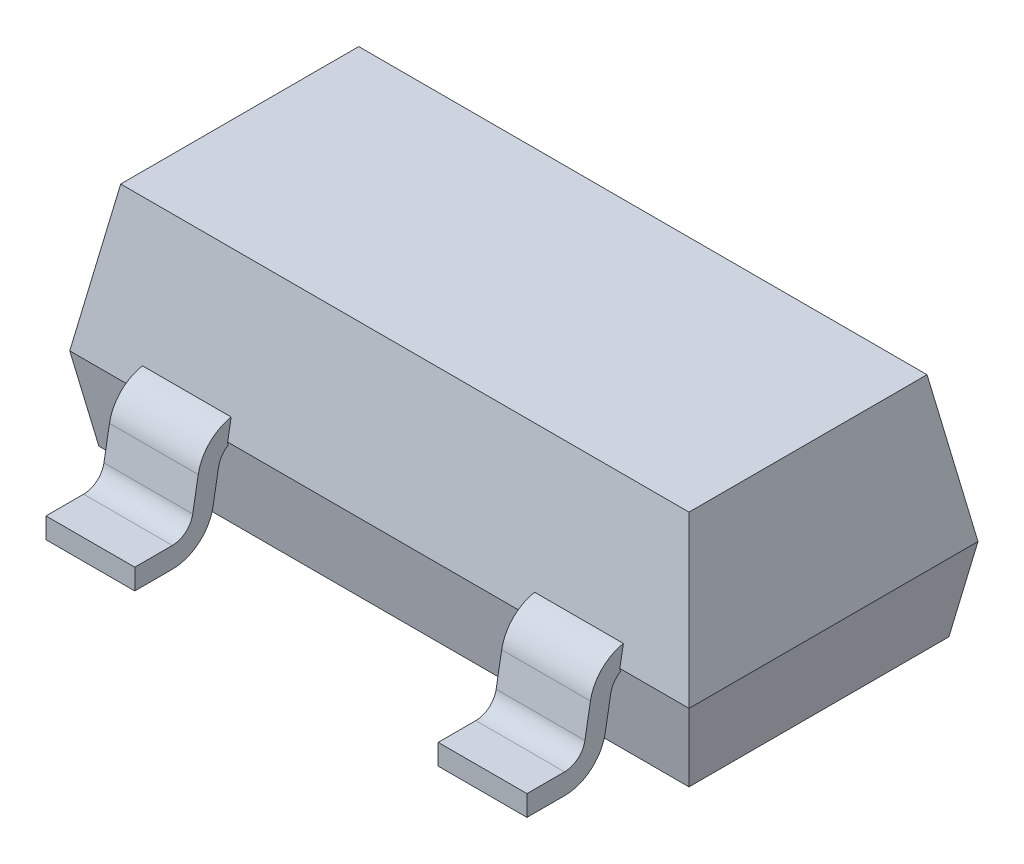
ISO-10303-21;
HEADER;
FILE_DESCRIPTION(('STEP AP214'),'2;1');
FILE_NAME('part.step','',(''),(''),'','','');
FILE_SCHEMA(('AUTOMOTIVE_DESIGN { 1 0 10303 214 1 1 1 1 }'));
ENDSEC;
DATA;
#1=APPLICATION_CONTEXT('core data for automotive mechanical design processes');
#2=APPLICATION_PROTOCOL_DEFINITION('international standard','automotive_design',2000,#1);
#3=PRODUCT_CONTEXT('',#1,'mechanical');
#4=PRODUCT('Part','Part','',(#3));
#5=PRODUCT_RELATED_PRODUCT_CATEGORY('part','',(#4));
#6=PRODUCT_DEFINITION_FORMATION('','',#4);
#7=PRODUCT_DEFINITION_CONTEXT('part definition',#1,'design');
#8=PRODUCT_DEFINITION('design','',#6,#7);
#9=PRODUCT_DEFINITION_SHAPE('','',#8);
#10=(LENGTH_UNIT() NAMED_UNIT(*) SI_UNIT(.MILLI.,.METRE.));
#11=(NAMED_UNIT(*) PLANE_ANGLE_UNIT() SI_UNIT($,.RADIAN.));
#12=(NAMED_UNIT(*) SI_UNIT($,.STERADIAN.) SOLID_ANGLE_UNIT());
#13=UNCERTAINTY_MEASURE_WITH_UNIT(LENGTH_MEASURE(1.E-05),#10,'distance_accuracy_value','');
#14=(GEOMETRIC_REPRESENTATION_CONTEXT(3) GLOBAL_UNCERTAINTY_ASSIGNED_CONTEXT((#13)) GLOBAL_UNIT_ASSIGNED_CONTEXT((#10,
#11,#12)) REPRESENTATION_CONTEXT('',''));
#15=CARTESIAN_POINT('',(0.,0.,0.));
#16=DIRECTION('',(0.,0.,1.));
#17=DIRECTION('',(1.,0.,0.));
#18=AXIS2_PLACEMENT_3D('',#15,#16,#17);
#19=CARTESIAN_POINT('',(-1.5,0.4,0.7));
#20=DIRECTION('',(0.,0.173648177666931,0.984807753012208));
#21=DIRECTION('',(0.,-0.984807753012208,0.173648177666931));
#22=AXIS2_PLACEMENT_3D('',#19,#20,#21);
#23=PLANE('',#22);
#24=DIRECTION('',(0.,-0.984807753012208,0.173648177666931));
#25=VECTOR('',#24,1.);
#26=CARTESIAN_POINT('',(-1.165,0.160230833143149,0.742277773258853));
#27=LINE('',#26,#25);
#28=CARTESIAN_POINT('',(-1.165,0.496466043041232,0.682990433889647));
#29=VERTEX_POINT('',#28);
#30=CARTESIAN_POINT('',(-1.165,0.4,0.7));
#31=VERTEX_POINT('',#30);
#32=EDGE_CURVE('E378',#29,#31,#27,.T.);
#33=ORIENTED_EDGE('',*,*,#32,.F.);
#34=DIRECTION('',(1.,0.,0.));
#35=VECTOR('',#34,1.);
#36=CARTESIAN_POINT('',(-1.165,0.496466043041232,0.682990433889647));
#37=LINE('',#36,#35);
#38=CARTESIAN_POINT('',(-0.735,0.496466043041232,0.682990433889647));
#39=VERTEX_POINT('',#38);
#40=EDGE_CURVE('E376',#29,#39,#37,.T.);
#41=ORIENTED_EDGE('',*,*,#40,.T.);
#42=DIRECTION('',(0.,-0.984807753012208,0.173648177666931));
#43=VECTOR('',#42,1.);
#44=CARTESIAN_POINT('',(-0.735,0.42003009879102,0.696468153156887));
#45=LINE('',#44,#43);
#46=CARTESIAN_POINT('',(-0.735,0.4,0.7));
#47=VERTEX_POINT('',#46);
#48=EDGE_CURVE('E374',#39,#47,#45,.T.);
#49=ORIENTED_EDGE('',*,*,#48,.T.);
#50=DIRECTION('',(-1.,0.,0.));
#51=VECTOR('',#50,1.);
#52=CARTESIAN_POINT('',(-1.5,0.4,0.7));
#53=LINE('',#52,#51);
#54=CARTESIAN_POINT('',(0.735,0.4,0.7));
#55=VERTEX_POINT('',#54);
#56=EDGE_CURVE('E46',#55,#47,#53,.T.);
#57=ORIENTED_EDGE('',*,*,#56,.F.);
#58=DIRECTION('',(0.,0.984807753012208,-0.173648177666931));
#59=VECTOR('',#58,1.);
#60=CARTESIAN_POINT('',(0.735,0.42003009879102,0.696468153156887));
#61=LINE('',#60,#59);
#62=CARTESIAN_POINT('',(0.735,0.496466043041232,0.682990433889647));
#63=VERTEX_POINT('',#62);
#64=EDGE_CURVE('E12',#55,#63,#61,.T.);
#65=ORIENTED_EDGE('',*,*,#64,.T.);
#66=DIRECTION('',(1.,0.,0.));
#67=VECTOR('',#66,1.);
#68=CARTESIAN_POINT('',(-1.165,0.496466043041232,0.682990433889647));
#69=LINE('',#68,#67);
#70=CARTESIAN_POINT('',(1.165,0.496466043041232,0.682990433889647));
#71=VERTEX_POINT('',#70);
#72=EDGE_CURVE('E370',#63,#71,#69,.T.);
#73=ORIENTED_EDGE('',*,*,#72,.T.);
#74=DIRECTION('',(0.,-0.984807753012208,0.173648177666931));
#75=VECTOR('',#74,1.);
#76=CARTESIAN_POINT('',(1.165,0.160230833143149,0.742277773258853));
#77=LINE('',#76,#75);
#78=CARTESIAN_POINT('',(1.165,0.4,0.7));
#79=VERTEX_POINT('',#78);
#80=EDGE_CURVE('E372',#71,#79,#77,.T.);
#81=ORIENTED_EDGE('',*,*,#80,.T.);
#82=CARTESIAN_POINT('',(1.5,0.4,0.7));
#83=VERTEX_POINT('',#82);
#84=EDGE_CURVE('E292',#83,#79,#53,.T.);
#85=ORIENTED_EDGE('',*,*,#84,.F.);
#86=DIRECTION('',(0.171087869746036,-0.970287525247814,0.171087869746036));
#87=VECTOR('',#86,1.);
#88=CARTESIAN_POINT('',(1.45902051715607,0.632406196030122,0.659020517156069));
#89=LINE('',#88,#87);
#90=CARTESIAN_POINT('',(1.37657111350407,1.1,0.576571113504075));
#91=VERTEX_POINT('',#90);
#92=EDGE_CURVE('E340',#91,#83,#89,.T.);
#93=ORIENTED_EDGE('',*,*,#92,.F.);
#94=DIRECTION('',(-1.,0.,0.));
#95=VECTOR('',#94,1.);
#96=CARTESIAN_POINT('',(-1.5,1.1,0.576571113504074));
#97=LINE('',#96,#95);
#98=CARTESIAN_POINT('',(-1.37657111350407,1.1,0.576571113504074));
#99=VERTEX_POINT('',#98);
#100=EDGE_CURVE('E310',#91,#99,#97,.T.);
#101=ORIENTED_EDGE('',*,*,#100,.T.);
#102=DIRECTION('',(-0.171087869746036,-0.970287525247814,0.171087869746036));
#103=VECTOR('',#102,1.);
#104=CARTESIAN_POINT('',(-1.5,0.4,0.7));
#105=LINE('',#104,#103);
#106=CARTESIAN_POINT('',(-1.5,0.4,0.7));
#107=VERTEX_POINT('',#106);
#108=EDGE_CURVE('E299',#99,#107,#105,.T.);
#109=ORIENTED_EDGE('',*,*,#108,.T.);
#110=EDGE_CURVE('E279',#31,#107,#53,.T.);
#111=ORIENTED_EDGE('',*,*,#110,.F.);
#112=EDGE_LOOP('',(#33,#41,#49,#57,#65,#73,#81,#85,#93,#101,#109,#111));
#113=FACE_BOUND('',#112,.T.);
#114=ADVANCED_FACE('F31',(#113),#23,.T.);
#115=CARTESIAN_POINT('',(-1.5,0.4,0.7));
#116=DIRECTION('',(0.,-0.173648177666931,0.984807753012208));
#117=DIRECTION('',(0.,-0.984807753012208,-0.173648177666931));
#118=AXIS2_PLACEMENT_3D('',#115,#116,#117);
#119=PLANE('',#118);
#120=DIRECTION('',(1.,0.,0.));
#121=VECTOR('',#120,1.);
#122=CARTESIAN_POINT('',(-1.165,0.385488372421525,0.697441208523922));
#123=LINE('',#122,#121);
#124=CARTESIAN_POINT('',(-1.165,0.385488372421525,0.697441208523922));
#125=VERTEX_POINT('',#124);
#126=CARTESIAN_POINT('',(-0.735,0.385488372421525,0.697441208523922));
#127=VERTEX_POINT('',#126);
#128=EDGE_CURVE('E366',#125,#127,#123,.T.);
#129=ORIENTED_EDGE('',*,*,#128,.F.);
#130=DIRECTION('',(0.,-0.984807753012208,-0.173648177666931));
#131=VECTOR('',#130,1.);
#132=CARTESIAN_POINT('',(-1.165,0.25183064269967,0.673873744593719));
#133=LINE('',#132,#131);
#134=EDGE_CURVE('E286',#125,#31,#133,.F.);
#135=ORIENTED_EDGE('',*,*,#134,.T.);
#136=ORIENTED_EDGE('',*,*,#110,.T.);
#137=DIRECTION('',(-0.171087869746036,0.970287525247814,0.171087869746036));
#138=VECTOR('',#137,1.);
#139=CARTESIAN_POINT('',(-1.45902051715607,0.167593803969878,0.659020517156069));
#140=LINE('',#139,#138);
#141=CARTESIAN_POINT('',(-1.42946920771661,0.,0.629469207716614));
#142=VERTEX_POINT('',#141);
#143=EDGE_CURVE('E284',#142,#107,#140,.T.);
#144=ORIENTED_EDGE('',*,*,#143,.F.);
#145=DIRECTION('',(-1.,0.,0.));
#146=VECTOR('',#145,1.);
#147=CARTESIAN_POINT('',(-1.5,0.,0.629469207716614));
#148=LINE('',#147,#146);
#149=CARTESIAN_POINT('',(1.42946920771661,0.,0.629469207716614));
#150=VERTEX_POINT('',#149);
#151=EDGE_CURVE('E327',#142,#150,#148,.F.);
#152=ORIENTED_EDGE('',*,*,#151,.T.);
#153=DIRECTION('',(0.171087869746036,0.970287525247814,0.171087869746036));
#154=VECTOR('',#153,1.);
#155=CARTESIAN_POINT('',(1.41218682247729,-0.0980132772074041,0.612186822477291));
#156=LINE('',#155,#154);
#157=EDGE_CURVE('E316',#150,#83,#156,.T.);
#158=ORIENTED_EDGE('',*,*,#157,.T.);
#159=ORIENTED_EDGE('',*,*,#84,.T.);
#160=DIRECTION('',(0.,-0.984807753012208,-0.173648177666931));
#161=VECTOR('',#160,1.);
#162=CARTESIAN_POINT('',(1.165,0.25183064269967,0.673873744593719));
#163=LINE('',#162,#161);
#164=CARTESIAN_POINT('',(1.165,0.385488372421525,0.697441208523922));
#165=VERTEX_POINT('',#164);
#166=EDGE_CURVE('E360',#165,#79,#163,.F.);
#167=ORIENTED_EDGE('',*,*,#166,.F.);
#168=DIRECTION('',(1.,0.,0.));
#169=VECTOR('',#168,1.);
#170=CARTESIAN_POINT('',(-1.165,0.385488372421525,0.697441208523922));
#171=LINE('',#170,#169);
#172=CARTESIAN_POINT('',(0.735,0.385488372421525,0.697441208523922));
#173=VERTEX_POINT('',#172);
#174=EDGE_CURVE('E52',#173,#165,#171,.T.);
#175=ORIENTED_EDGE('',*,*,#174,.F.);
#176=DIRECTION('',(0.,0.984807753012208,0.173648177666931));
#177=VECTOR('',#176,1.);
#178=CARTESIAN_POINT('',(0.735,0.573939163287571,0.730670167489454));
#179=LINE('',#178,#177);
#180=EDGE_CURVE('E39',#55,#173,#179,.F.);
#181=ORIENTED_EDGE('',*,*,#180,.F.);
#182=ORIENTED_EDGE('',*,*,#56,.T.);
#183=DIRECTION('',(0.,-0.984807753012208,-0.173648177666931));
#184=VECTOR('',#183,1.);
#185=CARTESIAN_POINT('',(-0.735,0.573939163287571,0.730670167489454));
#186=LINE('',#185,#184);
#187=EDGE_CURVE('E363',#127,#47,#186,.F.);
#188=ORIENTED_EDGE('',*,*,#187,.F.);
#189=EDGE_LOOP('',(#129,#135,#136,#144,#152,#158,#159,#167,#175,#181,#182,#188));
#190=FACE_BOUND('',#189,.T.);
#191=ADVANCED_FACE('F281',(#190),#119,.T.);
#192=CARTESIAN_POINT('',(-1.5,0.4,-0.7));
#193=DIRECTION('',(-0.984807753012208,0.173648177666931,0.));
#194=DIRECTION('',(-0.173648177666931,-0.984807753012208,0.));
#195=AXIS2_PLACEMENT_3D('',#192,#193,#194);
#196=PLANE('',#195);
#197=ORIENTED_EDGE('',*,*,#108,.F.);
#198=DIRECTION('',(0.,0.,-1.));
#199=VECTOR('',#198,1.);
#200=CARTESIAN_POINT('',(-1.37657111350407,1.1,-0.7));
#201=LINE('',#200,#199);
#202=CARTESIAN_POINT('',(-1.37657111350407,1.1,-0.576571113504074));
#203=VERTEX_POINT('',#202);
#204=EDGE_CURVE('E341',#99,#203,#201,.T.);
#205=ORIENTED_EDGE('',*,*,#204,.T.);
#206=DIRECTION('',(-0.171087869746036,-0.970287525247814,-0.171087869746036));
#207=VECTOR('',#206,1.);
#208=CARTESIAN_POINT('',(-1.5,0.4,-0.7));
#209=LINE('',#208,#207);
#210=CARTESIAN_POINT('',(-1.5,0.4,-0.7));
#211=VERTEX_POINT('',#210);
#212=EDGE_CURVE('E302',#203,#211,#209,.T.);
#213=ORIENTED_EDGE('',*,*,#212,.T.);
#214=DIRECTION('',(0.,0.,-1.));
#215=VECTOR('',#214,1.);
#216=CARTESIAN_POINT('',(-1.5,0.4,-0.7));
#217=LINE('',#216,#215);
#218=EDGE_CURVE('E296',#107,#211,#217,.T.);
#219=ORIENTED_EDGE('',*,*,#218,.F.);
#220=EDGE_LOOP('',(#197,#205,#213,#219));
#221=FACE_BOUND('',#220,.T.);
#222=ADVANCED_FACE('F297',(#221),#196,.T.);
#223=CARTESIAN_POINT('',(1.5,0.4,-0.7));
#224=DIRECTION('',(0.984807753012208,0.173648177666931,0.));
#225=DIRECTION('',(-0.173648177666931,0.984807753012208,0.));
#226=AXIS2_PLACEMENT_3D('',#223,#224,#225);
#227=PLANE('',#226);
#228=DIRECTION('',(0.171087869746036,-0.970287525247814,-0.171087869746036));
#229=VECTOR('',#228,1.);
#230=CARTESIAN_POINT('',(1.41218682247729,0.898013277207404,-0.61218682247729));
#231=LINE('',#230,#229);
#232=CARTESIAN_POINT('',(1.37657111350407,1.1,-0.576571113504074));
#233=VERTEX_POINT('',#232);
#234=CARTESIAN_POINT('',(1.5,0.4,-0.7));
#235=VERTEX_POINT('',#234);
#236=EDGE_CURVE('E307',#233,#235,#231,.T.);
#237=ORIENTED_EDGE('',*,*,#236,.F.);
#238=DIRECTION('',(0.,0.,1.));
#239=VECTOR('',#238,1.);
#240=CARTESIAN_POINT('',(1.37657111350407,1.1,-0.7));
#241=LINE('',#240,#239);
#242=EDGE_CURVE('E311',#233,#91,#241,.T.);
#243=ORIENTED_EDGE('',*,*,#242,.T.);
#244=ORIENTED_EDGE('',*,*,#92,.T.);
#245=DIRECTION('',(0.,0.,1.));
#246=VECTOR('',#245,1.);
#247=CARTESIAN_POINT('',(1.5,0.4,-0.7));
#248=LINE('',#247,#246);
#249=EDGE_CURVE('E290',#235,#83,#248,.T.);
#250=ORIENTED_EDGE('',*,*,#249,.F.);
#251=EDGE_LOOP('',(#237,#243,#244,#250));
#252=FACE_BOUND('',#251,.T.);
#253=ADVANCED_FACE('F644',(#252),#227,.T.);
#254=CARTESIAN_POINT('',(-1.5,0.4,-0.7));
#255=DIRECTION('',(0.,0.173648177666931,-0.984807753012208));
#256=DIRECTION('',(0.,0.984807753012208,0.173648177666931));
#257=AXIS2_PLACEMENT_3D('',#254,#255,#256);
#258=PLANE('',#257);
#259=DIRECTION('',(1.,0.,0.));
#260=VECTOR('',#259,1.);
#261=CARTESIAN_POINT('',(-1.165,0.496466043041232,-0.682990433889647));
#262=LINE('',#261,#260);
#263=CARTESIAN_POINT('',(0.215,0.496466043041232,-0.682990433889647));
#264=VERTEX_POINT('',#263);
#265=CARTESIAN_POINT('',(-0.215,0.496466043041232,-0.682990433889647));
#266=VERTEX_POINT('',#265);
#267=EDGE_CURVE('E355',#264,#266,#262,.F.);
#268=ORIENTED_EDGE('',*,*,#267,.T.);
#269=DIRECTION('',(0.,-0.984807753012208,-0.173648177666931));
#270=VECTOR('',#269,1.);
#271=CARTESIAN_POINT('',(-0.215,0.42003009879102,-0.696468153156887));
#272=LINE('',#271,#270);
#273=CARTESIAN_POINT('',(-0.215,0.4,-0.7));
#274=VERTEX_POINT('',#273);
#275=EDGE_CURVE('E357',#266,#274,#272,.T.);
#276=ORIENTED_EDGE('',*,*,#275,.T.);
#277=DIRECTION('',(1.,0.,0.));
#278=VECTOR('',#277,1.);
#279=CARTESIAN_POINT('',(-1.5,0.4,-0.7));
#280=LINE('',#279,#278);
#281=EDGE_CURVE('E334',#211,#274,#280,.T.);
#282=ORIENTED_EDGE('',*,*,#281,.F.);
#283=ORIENTED_EDGE('',*,*,#212,.F.);
#284=DIRECTION('',(1.,0.,0.));
#285=VECTOR('',#284,1.);
#286=CARTESIAN_POINT('',(-1.5,1.1,-0.576571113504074));
#287=LINE('',#286,#285);
#288=EDGE_CURVE('E337',#203,#233,#287,.T.);
#289=ORIENTED_EDGE('',*,*,#288,.T.);
#290=ORIENTED_EDGE('',*,*,#236,.T.);
#291=CARTESIAN_POINT('',(0.215,0.4,-0.7));
#292=VERTEX_POINT('',#291);
#293=EDGE_CURVE('E306',#292,#235,#280,.T.);
#294=ORIENTED_EDGE('',*,*,#293,.F.);
#295=DIRECTION('',(0.,0.984807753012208,0.173648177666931));
#296=VECTOR('',#295,1.);
#297=CARTESIAN_POINT('',(0.215,0.42003009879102,-0.696468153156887));
#298=LINE('',#297,#296);
#299=EDGE_CURVE('E593',#292,#264,#298,.T.);
#300=ORIENTED_EDGE('',*,*,#299,.T.);
#301=EDGE_LOOP('',(#268,#276,#282,#283,#289,#290,#294,#300));
#302=FACE_BOUND('',#301,.T.);
#303=ADVANCED_FACE('F648',(#302),#258,.T.);
#304=CARTESIAN_POINT('',(0.,1.1,0.));
#305=DIRECTION('',(0.,1.,0.));
#306=DIRECTION('',(0.,0.,1.));
#307=AXIS2_PLACEMENT_3D('',#304,#305,#306);
#308=PLANE('',#307);
#309=ORIENTED_EDGE('',*,*,#204,.F.);
#310=ORIENTED_EDGE('',*,*,#100,.F.);
#311=ORIENTED_EDGE('',*,*,#242,.F.);
#312=ORIENTED_EDGE('',*,*,#288,.F.);
#313=EDGE_LOOP('',(#309,#310,#311,#312));
#314=FACE_BOUND('',#313,.T.);
#315=ADVANCED_FACE('F646',(#314),#308,.T.);
#316=CARTESIAN_POINT('',(1.5,0.4,-0.7));
#317=DIRECTION('',(0.984807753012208,-0.173648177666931,0.));
#318=DIRECTION('',(0.173648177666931,0.984807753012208,0.));
#319=AXIS2_PLACEMENT_3D('',#316,#317,#318);
#320=PLANE('',#319);
#321=ORIENTED_EDGE('',*,*,#157,.F.);
#322=DIRECTION('',(0.,0.,1.));
#323=VECTOR('',#322,1.);
#324=CARTESIAN_POINT('',(1.42946920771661,0.,-0.7));
#325=LINE('',#324,#323);
#326=CARTESIAN_POINT('',(1.42946920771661,0.,-0.629469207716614));
#327=VERTEX_POINT('',#326);
#328=EDGE_CURVE('E328',#150,#327,#325,.F.);
#329=ORIENTED_EDGE('',*,*,#328,.T.);
#330=DIRECTION('',(0.171087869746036,0.970287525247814,-0.171087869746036));
#331=VECTOR('',#330,1.);
#332=CARTESIAN_POINT('',(1.5,0.4,-0.7));
#333=LINE('',#332,#331);
#334=EDGE_CURVE('E319',#327,#235,#333,.T.);
#335=ORIENTED_EDGE('',*,*,#334,.T.);
#336=ORIENTED_EDGE('',*,*,#249,.T.);
#337=EDGE_LOOP('',(#321,#329,#335,#336));
#338=FACE_BOUND('',#337,.T.);
#339=ADVANCED_FACE('F661',(#338),#320,.T.);
#340=CARTESIAN_POINT('',(-1.5,0.4,-0.7));
#341=DIRECTION('',(0.,-0.173648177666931,-0.984807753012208));
#342=DIRECTION('',(0.,0.984807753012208,-0.173648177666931));
#343=AXIS2_PLACEMENT_3D('',#340,#341,#342);
#344=PLANE('',#343);
#345=DIRECTION('',(0.,-0.984807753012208,0.173648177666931));
#346=VECTOR('',#345,1.);
#347=CARTESIAN_POINT('',(-0.215,0.573939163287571,-0.730670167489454));
#348=LINE('',#347,#346);
#349=CARTESIAN_POINT('',(-0.215,0.385488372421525,-0.697441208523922));
#350=VERTEX_POINT('',#349);
#351=EDGE_CURVE('E352',#350,#274,#348,.F.);
#352=ORIENTED_EDGE('',*,*,#351,.F.);
#353=DIRECTION('',(1.,0.,0.));
#354=VECTOR('',#353,1.);
#355=CARTESIAN_POINT('',(-1.165,0.385488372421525,-0.697441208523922));
#356=LINE('',#355,#354);
#357=CARTESIAN_POINT('',(0.215,0.385488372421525,-0.697441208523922));
#358=VERTEX_POINT('',#357);
#359=EDGE_CURVE('E331',#358,#350,#356,.F.);
#360=ORIENTED_EDGE('',*,*,#359,.F.);
#361=DIRECTION('',(0.,0.984807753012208,-0.173648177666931));
#362=VECTOR('',#361,1.);
#363=CARTESIAN_POINT('',(0.215,0.573939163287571,-0.730670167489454));
#364=LINE('',#363,#362);
#365=EDGE_CURVE('E590',#292,#358,#364,.F.);
#366=ORIENTED_EDGE('',*,*,#365,.F.);
#367=ORIENTED_EDGE('',*,*,#293,.T.);
#368=ORIENTED_EDGE('',*,*,#334,.F.);
#369=DIRECTION('',(1.,0.,0.));
#370=VECTOR('',#369,1.);
#371=CARTESIAN_POINT('',(-1.5,0.,-0.629469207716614));
#372=LINE('',#371,#370);
#373=CARTESIAN_POINT('',(-1.42946920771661,0.,-0.629469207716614));
#374=VERTEX_POINT('',#373);
#375=EDGE_CURVE('E655',#327,#374,#372,.F.);
#376=ORIENTED_EDGE('',*,*,#375,.T.);
#377=DIRECTION('',(-0.171087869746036,0.970287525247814,-0.171087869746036));
#378=VECTOR('',#377,1.);
#379=CARTESIAN_POINT('',(-1.5,0.4,-0.7));
#380=LINE('',#379,#378);
#381=EDGE_CURVE('E322',#374,#211,#380,.T.);
#382=ORIENTED_EDGE('',*,*,#381,.T.);
#383=ORIENTED_EDGE('',*,*,#281,.T.);
#384=EDGE_LOOP('',(#352,#360,#366,#367,#368,#376,#382,#383));
#385=FACE_BOUND('',#384,.T.);
#386=ADVANCED_FACE('F653',(#385),#344,.T.);
#387=CARTESIAN_POINT('',(-1.5,0.4,-0.7));
#388=DIRECTION('',(-0.984807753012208,-0.173648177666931,0.));
#389=DIRECTION('',(0.173648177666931,-0.984807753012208,0.));
#390=AXIS2_PLACEMENT_3D('',#387,#388,#389);
#391=PLANE('',#390);
#392=ORIENTED_EDGE('',*,*,#381,.F.);
#393=DIRECTION('',(0.,0.,-1.));
#394=VECTOR('',#393,1.);
#395=CARTESIAN_POINT('',(-1.42946920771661,0.,-0.7));
#396=LINE('',#395,#394);
#397=EDGE_CURVE('E315',#374,#142,#396,.F.);
#398=ORIENTED_EDGE('',*,*,#397,.T.);
#399=ORIENTED_EDGE('',*,*,#143,.T.);
#400=ORIENTED_EDGE('',*,*,#218,.T.);
#401=EDGE_LOOP('',(#392,#398,#399,#400));
#402=FACE_BOUND('',#401,.T.);
#403=ADVANCED_FACE('F314',(#402),#391,.T.);
#404=CARTESIAN_POINT('',(0.,0.,0.));
#405=DIRECTION('',(0.,1.,0.));
#406=DIRECTION('',(0.,0.,1.));
#407=AXIS2_PLACEMENT_3D('',#404,#405,#406);
#408=PLANE('',#407);
#409=ORIENTED_EDGE('',*,*,#375,.F.);
#410=ORIENTED_EDGE('',*,*,#328,.F.);
#411=ORIENTED_EDGE('',*,*,#151,.F.);
#412=ORIENTED_EDGE('',*,*,#397,.F.);
#413=EDGE_LOOP('',(#409,#410,#411,#412));
#414=FACE_BOUND('',#413,.T.);
#415=ADVANCED_FACE('F662',(#414),#408,.F.);
#416=CARTESIAN_POINT('',(-1.165,0.182635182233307,-0.869339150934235));
#417=DIRECTION('',(0.,0.173648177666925,-0.984807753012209));
#418=DIRECTION('',(0.,0.984807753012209,0.173648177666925));
#419=AXIS2_PLACEMENT_3D('',#416,#417,#418);
#420=PLANE('',#419);
#421=DIRECTION('',(1.,0.,0.));
#422=VECTOR('',#421,1.);
#423=CARTESIAN_POINT('',(-1.165,0.334729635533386,-0.842520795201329));
#424=LINE('',#423,#422);
#425=CARTESIAN_POINT('',(-0.215,0.334729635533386,-0.842520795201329));
#426=VERTEX_POINT('',#425);
#427=CARTESIAN_POINT('',(0.215,0.334729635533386,-0.842520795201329));
#428=VERTEX_POINT('',#427);
#429=EDGE_CURVE('E546',#426,#428,#424,.T.);
#430=ORIENTED_EDGE('',*,*,#429,.T.);
#431=DIRECTION('',(0.,-0.984807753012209,-0.173648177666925));
#432=VECTOR('',#431,1.);
#433=CARTESIAN_POINT('',(0.215,0.182635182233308,-0.869339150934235));
#434=LINE('',#433,#432);
#435=CARTESIAN_POINT('',(0.215,0.182635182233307,-0.869339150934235));
#436=VERTEX_POINT('',#435);
#437=EDGE_CURVE('E398',#428,#436,#434,.T.);
#438=ORIENTED_EDGE('',*,*,#437,.T.);
#439=DIRECTION('',(1.,0.,0.));
#440=VECTOR('',#439,1.);
#441=CARTESIAN_POINT('',(-1.165,0.182635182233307,-0.869339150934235));
#442=LINE('',#441,#440);
#443=CARTESIAN_POINT('',(-0.215,0.182635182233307,-0.869339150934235));
#444=VERTEX_POINT('',#443);
#445=EDGE_CURVE('E549',#444,#436,#442,.T.);
#446=ORIENTED_EDGE('',*,*,#445,.F.);
#447=DIRECTION('',(0.,0.984807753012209,0.173648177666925));
#448=VECTOR('',#447,1.);
#449=CARTESIAN_POINT('',(-0.215,0.182635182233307,-0.869339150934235));
#450=LINE('',#449,#448);
#451=EDGE_CURVE('E470',#444,#426,#450,.T.);
#452=ORIENTED_EDGE('',*,*,#451,.T.);
#453=EDGE_LOOP('',(#430,#438,#446,#452));
#454=FACE_BOUND('',#453,.T.);
#455=ADVANCED_FACE('F664',(#454),#420,.T.);
#456=CARTESIAN_POINT('',(-1.165,0.2,-0.967819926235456));
#457=DIRECTION('',(1.,0.,0.));
#458=DIRECTION('',(0.,0.,-1.));
#459=AXIS2_PLACEMENT_3D('',#456,#457,#458);
#460=CYLINDRICAL_SURFACE('',#459,0.1);
#461=ORIENTED_EDGE('',*,*,#445,.T.);
#462=CARTESIAN_POINT('',(0.215,0.2,-0.967819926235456));
#463=DIRECTION('',(1.,0.,0.));
#464=DIRECTION('',(0.,0.,-1.));
#465=AXIS2_PLACEMENT_3D('',#462,#463,#464);
#466=CIRCLE('',#465,0.1);
#467=CARTESIAN_POINT('',(0.215,0.1,-0.967819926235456));
#468=VERTEX_POINT('',#467);
#469=EDGE_CURVE('E395',#436,#468,#466,.T.);
#470=ORIENTED_EDGE('',*,*,#469,.T.);
#471=DIRECTION('',(1.,0.,0.));
#472=VECTOR('',#471,1.);
#473=CARTESIAN_POINT('',(-1.165,0.1,-0.967819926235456));
#474=LINE('',#473,#472);
#475=CARTESIAN_POINT('',(-0.215,0.1,-0.967819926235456));
#476=VERTEX_POINT('',#475);
#477=EDGE_CURVE('E552',#476,#468,#474,.T.);
#478=ORIENTED_EDGE('',*,*,#477,.F.);
#479=CARTESIAN_POINT('',(-0.215,0.2,-0.967819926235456));
#480=DIRECTION('',(-1.,0.,0.));
#481=DIRECTION('',(0.,0.,1.));
#482=AXIS2_PLACEMENT_3D('',#479,#480,#481);
#483=CIRCLE('',#482,0.1);
#484=EDGE_CURVE('E467',#476,#444,#483,.T.);
#485=ORIENTED_EDGE('',*,*,#484,.T.);
#486=EDGE_LOOP('',(#461,#470,#478,#485));
#487=FACE_BOUND('',#486,.T.);
#488=ADVANCED_FACE('F670',(#487),#460,.F.);
#489=CARTESIAN_POINT('',(-1.165,0.1,-1.15));
#490=DIRECTION('',(0.,1.,0.));
#491=DIRECTION('',(0.,0.,1.));
#492=AXIS2_PLACEMENT_3D('',#489,#490,#491);
#493=PLANE('',#492);
#494=ORIENTED_EDGE('',*,*,#477,.T.);
#495=DIRECTION('',(0.,0.,-1.));
#496=VECTOR('',#495,1.);
#497=CARTESIAN_POINT('',(0.215,0.1,-1.15));
#498=LINE('',#497,#496);
#499=CARTESIAN_POINT('',(0.215,0.1,-1.15));
#500=VERTEX_POINT('',#499);
#501=EDGE_CURVE('E392',#468,#500,#498,.T.);
#502=ORIENTED_EDGE('',*,*,#501,.T.);
#503=DIRECTION('',(1.,0.,0.));
#504=VECTOR('',#503,1.);
#505=CARTESIAN_POINT('',(-1.165,0.1,-1.15));
#506=LINE('',#505,#504);
#507=CARTESIAN_POINT('',(-0.215,0.1,-1.15));
#508=VERTEX_POINT('',#507);
#509=EDGE_CURVE('E555',#508,#500,#506,.T.);
#510=ORIENTED_EDGE('',*,*,#509,.F.);
#511=DIRECTION('',(0.,0.,1.));
#512=VECTOR('',#511,1.);
#513=CARTESIAN_POINT('',(-0.215,0.1,-1.15));
#514=LINE('',#513,#512);
#515=EDGE_CURVE('E464',#508,#476,#514,.T.);
#516=ORIENTED_EDGE('',*,*,#515,.T.);
#517=EDGE_LOOP('',(#494,#502,#510,#516));
#518=FACE_BOUND('',#517,.T.);
#519=ADVANCED_FACE('F734',(#518),#493,.T.);
#520=CARTESIAN_POINT('',(-1.165,0.,-1.15));
#521=DIRECTION('',(0.,0.,-1.));
#522=DIRECTION('',(-1.,0.,0.));
#523=AXIS2_PLACEMENT_3D('',#520,#521,#522);
#524=PLANE('',#523);
#525=ORIENTED_EDGE('',*,*,#509,.T.);
#526=DIRECTION('',(0.,-1.,0.));
#527=VECTOR('',#526,1.);
#528=CARTESIAN_POINT('',(0.215,0.5,-1.15));
#529=LINE('',#528,#527);
#530=CARTESIAN_POINT('',(0.215,0.,-1.15));
#531=VERTEX_POINT('',#530);
#532=EDGE_CURVE('E383',#500,#531,#529,.T.);
#533=ORIENTED_EDGE('',*,*,#532,.T.);
#534=DIRECTION('',(1.,0.,0.));
#535=VECTOR('',#534,1.);
#536=CARTESIAN_POINT('',(-1.165,0.,-1.15));
#537=LINE('',#536,#535);
#538=CARTESIAN_POINT('',(-0.215,0.,-1.15));
#539=VERTEX_POINT('',#538);
#540=EDGE_CURVE('E558',#539,#531,#537,.T.);
#541=ORIENTED_EDGE('',*,*,#540,.F.);
#542=DIRECTION('',(0.,-1.,0.));
#543=VECTOR('',#542,1.);
#544=CARTESIAN_POINT('',(-0.215,0.5,-1.15));
#545=LINE('',#544,#543);
#546=EDGE_CURVE('E454',#508,#539,#545,.T.);
#547=ORIENTED_EDGE('',*,*,#546,.F.);
#548=EDGE_LOOP('',(#525,#533,#541,#547));
#549=FACE_BOUND('',#548,.T.);
#550=ADVANCED_FACE('F738',(#549),#524,.T.);
#551=CARTESIAN_POINT('',(-1.165,0.,-1.15));
#552=DIRECTION('',(0.,-1.,0.));
#553=DIRECTION('',(0.,0.,-1.));
#554=AXIS2_PLACEMENT_3D('',#551,#552,#553);
#555=PLANE('',#554);
#556=ORIENTED_EDGE('',*,*,#540,.T.);
#557=DIRECTION('',(0.,0.,1.));
#558=VECTOR('',#557,1.);
#559=CARTESIAN_POINT('',(0.215,0.,-1.15));
#560=LINE('',#559,#558);
#561=CARTESIAN_POINT('',(0.215,0.,-0.967819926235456));
#562=VERTEX_POINT('',#561);
#563=EDGE_CURVE('E380',#531,#562,#560,.T.);
#564=ORIENTED_EDGE('',*,*,#563,.T.);
#565=DIRECTION('',(1.,0.,0.));
#566=VECTOR('',#565,1.);
#567=CARTESIAN_POINT('',(-1.165,0.,-0.967819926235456));
#568=LINE('',#567,#566);
#569=CARTESIAN_POINT('',(-0.215,0.,-0.967819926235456));
#570=VERTEX_POINT('',#569);
#571=EDGE_CURVE('E561',#570,#562,#568,.T.);
#572=ORIENTED_EDGE('',*,*,#571,.F.);
#573=DIRECTION('',(0.,0.,-1.));
#574=VECTOR('',#573,1.);
#575=CARTESIAN_POINT('',(-0.215,0.,-1.15));
#576=LINE('',#575,#574);
#577=EDGE_CURVE('E451',#570,#539,#576,.T.);
#578=ORIENTED_EDGE('',*,*,#577,.T.);
#579=EDGE_LOOP('',(#556,#564,#572,#578));
#580=FACE_BOUND('',#579,.T.);
#581=ADVANCED_FACE('F742',(#580),#555,.T.);
#582=CARTESIAN_POINT('',(-1.165,0.2,-0.967819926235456));
#583=DIRECTION('',(1.,0.,0.));
#584=DIRECTION('',(0.,0.,-1.));
#585=AXIS2_PLACEMENT_3D('',#582,#583,#584);
#586=CYLINDRICAL_SURFACE('',#585,0.2);
#587=ORIENTED_EDGE('',*,*,#571,.T.);
#588=CARTESIAN_POINT('',(0.215,0.2,-0.967819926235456));
#589=DIRECTION('',(1.,0.,0.));
#590=DIRECTION('',(0.,0.,-1.));
#591=AXIS2_PLACEMENT_3D('',#588,#589,#590);
#592=CIRCLE('',#591,0.2);
#593=CARTESIAN_POINT('',(0.215,0.165270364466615,-0.770858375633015));
#594=VERTEX_POINT('',#593);
#595=EDGE_CURVE('E389',#562,#594,#592,.F.);
#596=ORIENTED_EDGE('',*,*,#595,.T.);
#597=DIRECTION('',(1.,0.,0.));
#598=VECTOR('',#597,1.);
#599=CARTESIAN_POINT('',(-1.165,0.165270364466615,-0.770858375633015));
#600=LINE('',#599,#598);
#601=CARTESIAN_POINT('',(-0.215,0.165270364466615,-0.770858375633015));
#602=VERTEX_POINT('',#601);
#603=EDGE_CURVE('E564',#602,#594,#600,.T.);
#604=ORIENTED_EDGE('',*,*,#603,.F.);
#605=CARTESIAN_POINT('',(-0.215,0.2,-0.967819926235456));
#606=DIRECTION('',(-1.,0.,0.));
#607=DIRECTION('',(0.,0.,1.));
#608=AXIS2_PLACEMENT_3D('',#605,#606,#607);
#609=CIRCLE('',#608,0.2);
#610=EDGE_CURVE('E461',#602,#570,#609,.F.);
#611=ORIENTED_EDGE('',*,*,#610,.T.);
#612=EDGE_LOOP('',(#587,#596,#604,#611));
#613=FACE_BOUND('',#612,.T.);
#614=ADVANCED_FACE('F746',(#613),#586,.T.);
#615=CARTESIAN_POINT('',(-1.165,0.165270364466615,-0.770858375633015));
#616=DIRECTION('',(0.,-0.173648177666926,0.984807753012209));
#617=DIRECTION('',(0.,-0.984807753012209,-0.173648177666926));
#618=AXIS2_PLACEMENT_3D('',#615,#616,#617);
#619=PLANE('',#618);
#620=ORIENTED_EDGE('',*,*,#603,.T.);
#621=DIRECTION('',(0.,0.984807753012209,0.173648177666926));
#622=VECTOR('',#621,1.);
#623=CARTESIAN_POINT('',(0.215,0.165270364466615,-0.770858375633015));
#624=LINE('',#623,#622);
#625=CARTESIAN_POINT('',(0.215,0.317364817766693,-0.744040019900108));
#626=VERTEX_POINT('',#625);
#627=EDGE_CURVE('E386',#594,#626,#624,.T.);
#628=ORIENTED_EDGE('',*,*,#627,.T.);
#629=DIRECTION('',(1.,0.,0.));
#630=VECTOR('',#629,1.);
#631=CARTESIAN_POINT('',(-1.165,0.317364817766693,-0.744040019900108));
#632=LINE('',#631,#630);
#633=CARTESIAN_POINT('',(-0.215,0.317364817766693,-0.744040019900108));
#634=VERTEX_POINT('',#633);
#635=EDGE_CURVE('E567',#634,#626,#632,.T.);
#636=ORIENTED_EDGE('',*,*,#635,.F.);
#637=DIRECTION('',(0.,-0.984807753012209,-0.173648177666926));
#638=VECTOR('',#637,1.);
#639=CARTESIAN_POINT('',(-0.215,0.165270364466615,-0.770858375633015));
#640=LINE('',#639,#638);
#641=EDGE_CURVE('E458',#634,#602,#640,.T.);
#642=ORIENTED_EDGE('',*,*,#641,.T.);
#643=EDGE_LOOP('',(#620,#628,#636,#642));
#644=FACE_BOUND('',#643,.T.);
#645=ADVANCED_FACE('F702',(#644),#619,.T.);
#646=CARTESIAN_POINT('',(-0.215,0.5,-1.15));
#647=DIRECTION('',(-1.,0.,0.));
#648=DIRECTION('',(0.,0.,1.));
#649=AXIS2_PLACEMENT_3D('',#646,#647,#648);
#650=PLANE('',#649);
#651=ORIENTED_EDGE('',*,*,#275,.F.);
#652=CARTESIAN_POINT('',(-0.215,0.3,-0.645559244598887));
#653=DIRECTION('',(-1.,0.,0.));
#654=DIRECTION('',(0.,0.,1.));
#655=AXIS2_PLACEMENT_3D('',#652,#653,#654);
#656=CIRCLE('',#655,0.2);
#657=EDGE_CURVE('E473',#426,#266,#656,.F.);
#658=ORIENTED_EDGE('',*,*,#657,.F.);
#659=ORIENTED_EDGE('',*,*,#451,.F.);
#660=ORIENTED_EDGE('',*,*,#484,.F.);
#661=ORIENTED_EDGE('',*,*,#515,.F.);
#662=ORIENTED_EDGE('',*,*,#546,.T.);
#663=ORIENTED_EDGE('',*,*,#577,.F.);
#664=ORIENTED_EDGE('',*,*,#610,.F.);
#665=ORIENTED_EDGE('',*,*,#641,.F.);
#666=CARTESIAN_POINT('',(-0.215,0.3,-0.645559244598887));
#667=DIRECTION('',(-1.,0.,0.));
#668=DIRECTION('',(0.,0.,1.));
#669=AXIS2_PLACEMENT_3D('',#666,#667,#668);
#670=CIRCLE('',#669,0.1);
#671=EDGE_CURVE('E456',#350,#634,#670,.T.);
#672=ORIENTED_EDGE('',*,*,#671,.F.);
#673=ORIENTED_EDGE('',*,*,#351,.T.);
#674=EDGE_LOOP('',(#651,#658,#659,#660,#661,#662,#663,#664,#665,#672,#673));
#675=FACE_BOUND('',#674,.T.);
#676=ADVANCED_FACE('F691',(#675),#650,.T.);
#677=CARTESIAN_POINT('',(0.215,0.5,-1.15));
#678=DIRECTION('',(1.,0.,0.));
#679=DIRECTION('',(0.,0.,-1.));
#680=AXIS2_PLACEMENT_3D('',#677,#678,#679);
#681=PLANE('',#680);
#682=ORIENTED_EDGE('',*,*,#299,.F.);
#683=ORIENTED_EDGE('',*,*,#365,.T.);
#684=CARTESIAN_POINT('',(0.215,0.3,-0.645559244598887));
#685=DIRECTION('',(1.,0.,0.));
#686=DIRECTION('',(0.,0.,-1.));
#687=AXIS2_PLACEMENT_3D('',#684,#685,#686);
#688=CIRCLE('',#687,0.1);
#689=EDGE_CURVE('E587',#626,#358,#688,.T.);
#690=ORIENTED_EDGE('',*,*,#689,.F.);
#691=ORIENTED_EDGE('',*,*,#627,.F.);
#692=ORIENTED_EDGE('',*,*,#595,.F.);
#693=ORIENTED_EDGE('',*,*,#563,.F.);
#694=ORIENTED_EDGE('',*,*,#532,.F.);
#695=ORIENTED_EDGE('',*,*,#501,.F.);
#696=ORIENTED_EDGE('',*,*,#469,.F.);
#697=ORIENTED_EDGE('',*,*,#437,.F.);
#698=CARTESIAN_POINT('',(0.215,0.3,-0.645559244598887));
#699=DIRECTION('',(1.,0.,0.));
#700=DIRECTION('',(0.,0.,-1.));
#701=AXIS2_PLACEMENT_3D('',#698,#699,#700);
#702=CIRCLE('',#701,0.2);
#703=EDGE_CURVE('E401',#264,#428,#702,.F.);
#704=ORIENTED_EDGE('',*,*,#703,.F.);
#705=EDGE_LOOP('',(#682,#683,#690,#691,#692,#693,#694,#695,#696,#697,#704));
#706=FACE_BOUND('',#705,.T.);
#707=ADVANCED_FACE('F687',(#706),#681,.T.);
#708=CARTESIAN_POINT('',(-1.165,0.3,-0.645559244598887));
#709=DIRECTION('',(1.,0.,0.));
#710=DIRECTION('',(0.,0.,-1.));
#711=AXIS2_PLACEMENT_3D('',#708,#709,#710);
#712=CYLINDRICAL_SURFACE('',#711,0.1);
#713=ORIENTED_EDGE('',*,*,#689,.T.);
#714=ORIENTED_EDGE('',*,*,#359,.T.);
#715=ORIENTED_EDGE('',*,*,#671,.T.);
#716=ORIENTED_EDGE('',*,*,#635,.T.);
#717=EDGE_LOOP('',(#713,#714,#715,#716));
#718=FACE_BOUND('',#717,.T.);
#719=ADVANCED_FACE('F690',(#718),#712,.F.);
#720=CARTESIAN_POINT('',(-1.165,0.3,-0.645559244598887));
#721=DIRECTION('',(1.,0.,0.));
#722=DIRECTION('',(0.,0.,-1.));
#723=AXIS2_PLACEMENT_3D('',#720,#721,#722);
#724=CYLINDRICAL_SURFACE('',#723,0.2);
#725=ORIENTED_EDGE('',*,*,#267,.F.);
#726=ORIENTED_EDGE('',*,*,#703,.T.);
#727=ORIENTED_EDGE('',*,*,#429,.F.);
#728=ORIENTED_EDGE('',*,*,#657,.T.);
#729=EDGE_LOOP('',(#725,#726,#727,#728));
#730=FACE_BOUND('',#729,.T.);
#731=ADVANCED_FACE('F728',(#730),#724,.T.);
#732=CARTESIAN_POINT('',(-1.165,0.182635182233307,0.869339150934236));
#733=DIRECTION('',(0.,0.173648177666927,0.984807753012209));
#734=DIRECTION('',(0.,-0.984807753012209,0.173648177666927));
#735=AXIS2_PLACEMENT_3D('',#732,#733,#734);
#736=PLANE('',#735);
#737=DIRECTION('',(1.,0.,0.));
#738=VECTOR('',#737,1.);
#739=CARTESIAN_POINT('',(-1.165,0.334729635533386,0.842520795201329));
#740=LINE('',#739,#738);
#741=CARTESIAN_POINT('',(0.735,0.334729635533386,0.842520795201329));
#742=VERTEX_POINT('',#741);
#743=CARTESIAN_POINT('',(1.165,0.334729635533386,0.842520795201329));
#744=VERTEX_POINT('',#743);
#745=EDGE_CURVE('E545',#742,#744,#740,.T.);
#746=ORIENTED_EDGE('',*,*,#745,.F.);
#747=DIRECTION('',(0.,-0.984807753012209,0.173648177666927));
#748=VECTOR('',#747,1.);
#749=CARTESIAN_POINT('',(0.735,0.182635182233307,0.869339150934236));
#750=LINE('',#749,#748);
#751=CARTESIAN_POINT('',(0.735,0.182635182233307,0.869339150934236));
#752=VERTEX_POINT('',#751);
#753=EDGE_CURVE('E422',#742,#752,#750,.T.);
#754=ORIENTED_EDGE('',*,*,#753,.T.);
#755=DIRECTION('',(1.,0.,0.));
#756=VECTOR('',#755,1.);
#757=CARTESIAN_POINT('',(-1.165,0.182635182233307,0.869339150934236));
#758=LINE('',#757,#756);
#759=CARTESIAN_POINT('',(1.165,0.182635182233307,0.869339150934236));
#760=VERTEX_POINT('',#759);
#761=EDGE_CURVE('E541',#752,#760,#758,.T.);
#762=ORIENTED_EDGE('',*,*,#761,.T.);
#763=DIRECTION('',(0.,-0.984807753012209,0.173648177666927));
#764=VECTOR('',#763,1.);
#765=CARTESIAN_POINT('',(1.165,0.182635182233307,0.869339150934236));
#766=LINE('',#765,#764);
#767=EDGE_CURVE('E521',#744,#760,#766,.T.);
#768=ORIENTED_EDGE('',*,*,#767,.F.);
#769=EDGE_LOOP('',(#746,#754,#762,#768));
#770=FACE_BOUND('',#769,.T.);
#771=ADVANCED_FACE('F630',(#770),#736,.T.);
#772=CARTESIAN_POINT('',(-1.165,0.2,0.967819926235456));
#773=DIRECTION('',(1.,0.,0.));
#774=DIRECTION('',(0.,0.,-1.));
#775=AXIS2_PLACEMENT_3D('',#772,#773,#774);
#776=CYLINDRICAL_SURFACE('',#775,0.1);
#777=ORIENTED_EDGE('',*,*,#761,.F.);
#778=CARTESIAN_POINT('',(0.735,0.2,0.967819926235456));
#779=DIRECTION('',(-1.,0.,0.));
#780=DIRECTION('',(0.,0.,1.));
#781=AXIS2_PLACEMENT_3D('',#778,#779,#780);
#782=CIRCLE('',#781,0.1);
#783=CARTESIAN_POINT('',(0.735,0.1,0.967819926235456));
#784=VERTEX_POINT('',#783);
#785=EDGE_CURVE('E425',#752,#784,#782,.T.);
#786=ORIENTED_EDGE('',*,*,#785,.T.);
#787=DIRECTION('',(1.,0.,0.));
#788=VECTOR('',#787,1.);
#789=CARTESIAN_POINT('',(-1.165,0.1,0.967819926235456));
#790=LINE('',#789,#788);
#791=CARTESIAN_POINT('',(1.165,0.1,0.967819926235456));
#792=VERTEX_POINT('',#791);
#793=EDGE_CURVE('E537',#784,#792,#790,.T.);
#794=ORIENTED_EDGE('',*,*,#793,.T.);
#795=CARTESIAN_POINT('',(1.165,0.2,0.967819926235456));
#796=DIRECTION('',(-1.,0.,0.));
#797=DIRECTION('',(0.,0.,-1.));
#798=AXIS2_PLACEMENT_3D('',#795,#796,#797);
#799=CIRCLE('',#798,0.1);
#800=EDGE_CURVE('E524',#760,#792,#799,.T.);
#801=ORIENTED_EDGE('',*,*,#800,.F.);
#802=EDGE_LOOP('',(#777,#786,#794,#801));
#803=FACE_BOUND('',#802,.T.);
#804=ADVANCED_FACE('F625',(#803),#776,.F.);
#805=CARTESIAN_POINT('',(-1.165,0.1,1.15));
#806=DIRECTION('',(0.,1.,0.));
#807=DIRECTION('',(0.,0.,1.));
#808=AXIS2_PLACEMENT_3D('',#805,#806,#807);
#809=PLANE('',#808);
#810=ORIENTED_EDGE('',*,*,#793,.F.);
#811=DIRECTION('',(0.,0.,1.));
#812=VECTOR('',#811,1.);
#813=CARTESIAN_POINT('',(0.735,0.1,1.15));
#814=LINE('',#813,#812);
#815=CARTESIAN_POINT('',(0.735,0.1,1.15));
#816=VERTEX_POINT('',#815);
#817=EDGE_CURVE('E428',#784,#816,#814,.T.);
#818=ORIENTED_EDGE('',*,*,#817,.T.);
#819=DIRECTION('',(1.,0.,0.));
#820=VECTOR('',#819,1.);
#821=CARTESIAN_POINT('',(-1.165,0.1,1.15));
#822=LINE('',#821,#820);
#823=CARTESIAN_POINT('',(1.165,0.1,1.15));
#824=VERTEX_POINT('',#823);
#825=EDGE_CURVE('E533',#816,#824,#822,.T.);
#826=ORIENTED_EDGE('',*,*,#825,.T.);
#827=DIRECTION('',(0.,0.,1.));
#828=VECTOR('',#827,1.);
#829=CARTESIAN_POINT('',(1.165,0.1,1.15));
#830=LINE('',#829,#828);
#831=EDGE_CURVE('E481',#792,#824,#830,.T.);
#832=ORIENTED_EDGE('',*,*,#831,.F.);
#833=EDGE_LOOP('',(#810,#818,#826,#832));
#834=FACE_BOUND('',#833,.T.);
#835=ADVANCED_FACE('F621',(#834),#809,.T.);
#836=CARTESIAN_POINT('',(-1.165,0.,1.15));
#837=DIRECTION('',(0.,0.,1.));
#838=DIRECTION('',(1.,0.,0.));
#839=AXIS2_PLACEMENT_3D('',#836,#837,#838);
#840=PLANE('',#839);
#841=ORIENTED_EDGE('',*,*,#825,.F.);
#842=DIRECTION('',(0.,-1.,0.));
#843=VECTOR('',#842,1.);
#844=CARTESIAN_POINT('',(0.735,0.5,1.15));
#845=LINE('',#844,#843);
#846=CARTESIAN_POINT('',(0.735,0.,1.15));
#847=VERTEX_POINT('',#846);
#848=EDGE_CURVE('E406',#816,#847,#845,.T.);
#849=ORIENTED_EDGE('',*,*,#848,.T.);
#850=DIRECTION('',(1.,0.,0.));
#851=VECTOR('',#850,1.);
#852=CARTESIAN_POINT('',(-1.165,0.,1.15));
#853=LINE('',#852,#851);
#854=CARTESIAN_POINT('',(1.165,0.,1.15));
#855=VERTEX_POINT('',#854);
#856=EDGE_CURVE('E504',#847,#855,#853,.T.);
#857=ORIENTED_EDGE('',*,*,#856,.T.);
#858=DIRECTION('',(0.,-1.,0.));
#859=VECTOR('',#858,1.);
#860=CARTESIAN_POINT('',(1.165,0.,1.15));
#861=LINE('',#860,#859);
#862=EDGE_CURVE('E476',#824,#855,#861,.T.);
#863=ORIENTED_EDGE('',*,*,#862,.F.);
#864=EDGE_LOOP('',(#841,#849,#857,#863));
#865=FACE_BOUND('',#864,.T.);
#866=ADVANCED_FACE('F616',(#865),#840,.T.);
#867=CARTESIAN_POINT('',(-1.165,0.,1.15));
#868=DIRECTION('',(0.,-1.,0.));
#869=DIRECTION('',(0.,0.,-1.));
#870=AXIS2_PLACEMENT_3D('',#867,#868,#869);
#871=PLANE('',#870);
#872=ORIENTED_EDGE('',*,*,#856,.F.);
#873=DIRECTION('',(0.,0.,-1.));
#874=VECTOR('',#873,1.);
#875=CARTESIAN_POINT('',(0.735,0.,1.15));
#876=LINE('',#875,#874);
#877=CARTESIAN_POINT('',(0.735,0.,0.967819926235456));
#878=VERTEX_POINT('',#877);
#879=EDGE_CURVE('E403',#847,#878,#876,.T.);
#880=ORIENTED_EDGE('',*,*,#879,.T.);
#881=DIRECTION('',(1.,0.,0.));
#882=VECTOR('',#881,1.);
#883=CARTESIAN_POINT('',(-1.165,0.,0.967819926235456));
#884=LINE('',#883,#882);
#885=CARTESIAN_POINT('',(1.165,0.,0.967819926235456));
#886=VERTEX_POINT('',#885);
#887=EDGE_CURVE('E581',#878,#886,#884,.T.);
#888=ORIENTED_EDGE('',*,*,#887,.T.);
#889=DIRECTION('',(0.,0.,-1.));
#890=VECTOR('',#889,1.);
#891=CARTESIAN_POINT('',(1.165,0.,1.15));
#892=LINE('',#891,#890);
#893=EDGE_CURVE('E507',#855,#886,#892,.T.);
#894=ORIENTED_EDGE('',*,*,#893,.F.);
#895=EDGE_LOOP('',(#872,#880,#888,#894));
#896=FACE_BOUND('',#895,.T.);
#897=ADVANCED_FACE('F613',(#896),#871,.T.);
#898=CARTESIAN_POINT('',(-1.165,0.2,0.967819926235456));
#899=DIRECTION('',(1.,0.,0.));
#900=DIRECTION('',(0.,0.,-1.));
#901=AXIS2_PLACEMENT_3D('',#898,#899,#900);
#902=CYLINDRICAL_SURFACE('',#901,0.2);
#903=ORIENTED_EDGE('',*,*,#887,.F.);
#904=CARTESIAN_POINT('',(0.735,0.2,0.967819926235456));
#905=DIRECTION('',(-1.,0.,0.));
#906=DIRECTION('',(0.,0.,1.));
#907=AXIS2_PLACEMENT_3D('',#904,#905,#906);
#908=CIRCLE('',#907,0.2);
#909=CARTESIAN_POINT('',(0.735,0.165270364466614,0.770858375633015));
#910=VERTEX_POINT('',#909);
#911=EDGE_CURVE('E411',#878,#910,#908,.F.);
#912=ORIENTED_EDGE('',*,*,#911,.T.);
#913=DIRECTION('',(1.,0.,0.));
#914=VECTOR('',#913,1.);
#915=CARTESIAN_POINT('',(-1.165,0.165270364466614,0.770858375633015));
#916=LINE('',#915,#914);
#917=CARTESIAN_POINT('',(1.165,0.165270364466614,0.770858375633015));
#918=VERTEX_POINT('',#917);
#919=EDGE_CURVE('E577',#910,#918,#916,.T.);
#920=ORIENTED_EDGE('',*,*,#919,.T.);
#921=CARTESIAN_POINT('',(1.165,0.2,0.967819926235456));
#922=DIRECTION('',(1.,0.,0.));
#923=DIRECTION('',(0.,0.,-1.));
#924=AXIS2_PLACEMENT_3D('',#921,#922,#923);
#925=CIRCLE('',#924,0.2);
#926=EDGE_CURVE('E510',#886,#918,#925,.T.);
#927=ORIENTED_EDGE('',*,*,#926,.F.);
#928=EDGE_LOOP('',(#903,#912,#920,#927));
#929=FACE_BOUND('',#928,.T.);
#930=ADVANCED_FACE('F608',(#929),#902,.T.);
#931=CARTESIAN_POINT('',(-1.165,0.165270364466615,0.770858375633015));
#932=DIRECTION('',(0.,-0.173648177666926,-0.984807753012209));
#933=DIRECTION('',(0.,0.984807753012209,-0.173648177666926));
#934=AXIS2_PLACEMENT_3D('',#931,#932,#933);
#935=PLANE('',#934);
#936=ORIENTED_EDGE('',*,*,#919,.F.);
#937=DIRECTION('',(0.,0.984807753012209,-0.173648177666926));
#938=VECTOR('',#937,1.);
#939=CARTESIAN_POINT('',(0.735,0.165270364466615,0.770858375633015));
#940=LINE('',#939,#938);
#941=CARTESIAN_POINT('',(0.735,0.317364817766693,0.744040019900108));
#942=VERTEX_POINT('',#941);
#943=EDGE_CURVE('E414',#910,#942,#940,.T.);
#944=ORIENTED_EDGE('',*,*,#943,.T.);
#945=DIRECTION('',(1.,0.,0.));
#946=VECTOR('',#945,1.);
#947=CARTESIAN_POINT('',(-1.165,0.317364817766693,0.744040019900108));
#948=LINE('',#947,#946);
#949=CARTESIAN_POINT('',(1.165,0.317364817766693,0.744040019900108));
#950=VERTEX_POINT('',#949);
#951=EDGE_CURVE('E573',#942,#950,#948,.T.);
#952=ORIENTED_EDGE('',*,*,#951,.T.);
#953=DIRECTION('',(0.,0.984807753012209,-0.173648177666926));
#954=VECTOR('',#953,1.);
#955=CARTESIAN_POINT('',(1.165,0.165270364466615,0.770858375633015));
#956=LINE('',#955,#954);
#957=EDGE_CURVE('E513',#918,#950,#956,.T.);
#958=ORIENTED_EDGE('',*,*,#957,.F.);
#959=EDGE_LOOP('',(#936,#944,#952,#958));
#960=FACE_BOUND('',#959,.T.);
#961=ADVANCED_FACE('F605',(#960),#935,.T.);
#962=CARTESIAN_POINT('',(0.735,0.5,1.15));
#963=DIRECTION('',(-1.,0.,0.));
#964=DIRECTION('',(0.,0.,1.));
#965=AXIS2_PLACEMENT_3D('',#962,#963,#964);
#966=PLANE('',#965);
#967=ORIENTED_EDGE('',*,*,#64,.F.);
#968=ORIENTED_EDGE('',*,*,#180,.T.);
#969=CARTESIAN_POINT('',(0.735,0.3,0.645559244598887));
#970=DIRECTION('',(-1.,0.,0.));
#971=DIRECTION('',(0.,0.,1.));
#972=AXIS2_PLACEMENT_3D('',#969,#970,#971);
#973=CIRCLE('',#972,0.1);
#974=EDGE_CURVE('E417',#942,#173,#973,.T.);
#975=ORIENTED_EDGE('',*,*,#974,.F.);
#976=ORIENTED_EDGE('',*,*,#943,.F.);
#977=ORIENTED_EDGE('',*,*,#911,.F.);
#978=ORIENTED_EDGE('',*,*,#879,.F.);
#979=ORIENTED_EDGE('',*,*,#848,.F.);
#980=ORIENTED_EDGE('',*,*,#817,.F.);
#981=ORIENTED_EDGE('',*,*,#785,.F.);
#982=ORIENTED_EDGE('',*,*,#753,.F.);
#983=CARTESIAN_POINT('',(0.735,0.3,0.645559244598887));
#984=DIRECTION('',(-1.,0.,0.));
#985=DIRECTION('',(0.,0.,1.));
#986=AXIS2_PLACEMENT_3D('',#983,#984,#985);
#987=CIRCLE('',#986,0.2);
#988=EDGE_CURVE('E420',#63,#742,#987,.F.);
#989=ORIENTED_EDGE('',*,*,#988,.F.);
#990=EDGE_LOOP('',(#967,#968,#975,#976,#977,#978,#979,#980,#981,#982,#989));
#991=FACE_BOUND('',#990,.T.);
#992=ADVANCED_FACE('F596',(#991),#966,.T.);
#993=CARTESIAN_POINT('',(-1.165,0.3,0.645559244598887));
#994=DIRECTION('',(1.,0.,0.));
#995=DIRECTION('',(0.,0.,-1.));
#996=AXIS2_PLACEMENT_3D('',#993,#994,#995);
#997=CYLINDRICAL_SURFACE('',#996,0.1);
#998=ORIENTED_EDGE('',*,*,#974,.T.);
#999=ORIENTED_EDGE('',*,*,#174,.T.);
#1000=CARTESIAN_POINT('',(1.165,0.3,0.645559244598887));
#1001=DIRECTION('',(-1.,0.,0.));
#1002=DIRECTION('',(0.,0.,1.));
#1003=AXIS2_PLACEMENT_3D('',#1000,#1001,#1002);
#1004=CIRCLE('',#1003,0.1);
#1005=EDGE_CURVE('E516',#950,#165,#1004,.T.);
#1006=ORIENTED_EDGE('',*,*,#1005,.F.);
#1007=ORIENTED_EDGE('',*,*,#951,.F.);
#1008=EDGE_LOOP('',(#998,#999,#1006,#1007));
#1009=FACE_BOUND('',#1008,.T.);
#1010=ADVANCED_FACE('F600',(#1009),#997,.F.);
#1011=CARTESIAN_POINT('',(-1.165,0.3,0.645559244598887));
#1012=DIRECTION('',(1.,0.,0.));
#1013=DIRECTION('',(0.,0.,-1.));
#1014=AXIS2_PLACEMENT_3D('',#1011,#1012,#1013);
#1015=CYLINDRICAL_SURFACE('',#1014,0.2);
#1016=ORIENTED_EDGE('',*,*,#72,.F.);
#1017=ORIENTED_EDGE('',*,*,#988,.T.);
#1018=ORIENTED_EDGE('',*,*,#745,.T.);
#1019=CARTESIAN_POINT('',(1.165,0.3,0.645559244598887));
#1020=DIRECTION('',(1.,0.,0.));
#1021=DIRECTION('',(0.,0.,1.));
#1022=AXIS2_PLACEMENT_3D('',#1019,#1020,#1021);
#1023=CIRCLE('',#1022,0.2);
#1024=EDGE_CURVE('E519',#71,#744,#1023,.T.);
#1025=ORIENTED_EDGE('',*,*,#1024,.F.);
#1026=EDGE_LOOP('',(#1016,#1017,#1018,#1025));
#1027=FACE_BOUND('',#1026,.T.);
#1028=ADVANCED_FACE('F634',(#1027),#1015,.T.);
#1029=CARTESIAN_POINT('',(1.165,0.2,0.967819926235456));
#1030=DIRECTION('',(1.,0.,0.));
#1031=DIRECTION('',(0.,0.,-1.));
#1032=AXIS2_PLACEMENT_3D('',#1029,#1030,#1031);
#1033=PLANE('',#1032);
#1034=ORIENTED_EDGE('',*,*,#80,.F.);
#1035=ORIENTED_EDGE('',*,*,#1024,.T.);
#1036=ORIENTED_EDGE('',*,*,#767,.T.);
#1037=ORIENTED_EDGE('',*,*,#800,.T.);
#1038=ORIENTED_EDGE('',*,*,#831,.T.);
#1039=ORIENTED_EDGE('',*,*,#862,.T.);
#1040=ORIENTED_EDGE('',*,*,#893,.T.);
#1041=ORIENTED_EDGE('',*,*,#926,.T.);
#1042=ORIENTED_EDGE('',*,*,#957,.T.);
#1043=ORIENTED_EDGE('',*,*,#1005,.T.);
#1044=ORIENTED_EDGE('',*,*,#166,.T.);
#1045=EDGE_LOOP('',(#1034,#1035,#1036,#1037,#1038,#1039,#1040,#1041,#1042,#1043,#1044));
#1046=FACE_BOUND('',#1045,.T.);
#1047=ADVANCED_FACE('F639',(#1046),#1033,.T.);
#1048=CARTESIAN_POINT('',(-1.165,0.3,0.645559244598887));
#1049=DIRECTION('',(-1.,0.,0.));
#1050=DIRECTION('',(0.,0.,1.));
#1051=AXIS2_PLACEMENT_3D('',#1048,#1049,#1050);
#1052=CIRCLE('',#1051,0.1);
#1053=CARTESIAN_POINT('',(-1.165,0.317364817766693,0.744040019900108));
#1054=VERTEX_POINT('',#1053);
#1055=EDGE_CURVE('E490',#1054,#125,#1052,.T.);
#1056=ORIENTED_EDGE('',*,*,#1055,.T.);
#1057=ORIENTED_EDGE('',*,*,#128,.T.);
#1058=CARTESIAN_POINT('',(-0.735,0.3,0.645559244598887));
#1059=DIRECTION('',(1.,0.,0.));
#1060=DIRECTION('',(0.,0.,-1.));
#1061=AXIS2_PLACEMENT_3D('',#1058,#1059,#1060);
#1062=CIRCLE('',#1061,0.1);
#1063=CARTESIAN_POINT('',(-0.735,0.317364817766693,0.744040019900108));
#1064=VERTEX_POINT('',#1063);
#1065=EDGE_CURVE('E437',#127,#1064,#1062,.T.);
#1066=ORIENTED_EDGE('',*,*,#1065,.T.);
#1067=EDGE_CURVE('E570',#1054,#1064,#948,.T.);
#1068=ORIENTED_EDGE('',*,*,#1067,.F.);
#1069=EDGE_LOOP('',(#1056,#1057,#1066,#1068));
#1070=FACE_BOUND('',#1069,.T.);
#1071=ADVANCED_FACE('F710',(#1070),#997,.F.);
#1072=CARTESIAN_POINT('',(-1.165,0.,1.15));
#1073=VERTEX_POINT('',#1072);
#1074=CARTESIAN_POINT('',(-0.735,0.,1.15));
#1075=VERTEX_POINT('',#1074);
#1076=EDGE_CURVE('E582',#1073,#1075,#853,.T.);
#1077=ORIENTED_EDGE('',*,*,#1076,.T.);
#1078=DIRECTION('',(0.,-1.,0.));
#1079=VECTOR('',#1078,1.);
#1080=CARTESIAN_POINT('',(-0.735,0.5,1.15));
#1081=LINE('',#1080,#1079);
#1082=CARTESIAN_POINT('',(-0.735,0.1,1.15));
#1083=VERTEX_POINT('',#1082);
#1084=EDGE_CURVE('E409',#1083,#1075,#1081,.T.);
#1085=ORIENTED_EDGE('',*,*,#1084,.F.);
#1086=CARTESIAN_POINT('',(-1.165,0.1,1.15));
#1087=VERTEX_POINT('',#1086);
#1088=EDGE_CURVE('E529',#1087,#1083,#822,.T.);
#1089=ORIENTED_EDGE('',*,*,#1088,.F.);
#1090=DIRECTION('',(0.,-1.,0.));
#1091=VECTOR('',#1090,1.);
#1092=CARTESIAN_POINT('',(-1.165,0.,1.15));
#1093=LINE('',#1092,#1091);
#1094=EDGE_CURVE('E477',#1087,#1073,#1093,.T.);
#1095=ORIENTED_EDGE('',*,*,#1094,.T.);
#1096=EDGE_LOOP('',(#1077,#1085,#1089,#1095));
#1097=FACE_BOUND('',#1096,.T.);
#1098=ADVANCED_FACE('F33',(#1097),#840,.T.);
#1099=ORIENTED_EDGE('',*,*,#1088,.T.);
#1100=DIRECTION('',(0.,0.,-1.));
#1101=VECTOR('',#1100,1.);
#1102=CARTESIAN_POINT('',(-0.735,0.1,1.15));
#1103=LINE('',#1102,#1101);
#1104=CARTESIAN_POINT('',(-0.735,0.1,0.967819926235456));
#1105=VERTEX_POINT('',#1104);
#1106=EDGE_CURVE('E448',#1083,#1105,#1103,.T.);
#1107=ORIENTED_EDGE('',*,*,#1106,.T.);
#1108=CARTESIAN_POINT('',(-1.165,0.1,0.967819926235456));
#1109=VERTEX_POINT('',#1108);
#1110=EDGE_CURVE('E534',#1109,#1105,#790,.T.);
#1111=ORIENTED_EDGE('',*,*,#1110,.F.);
#1112=DIRECTION('',(0.,0.,1.));
#1113=VECTOR('',#1112,1.);
#1114=CARTESIAN_POINT('',(-1.165,0.1,1.15));
#1115=LINE('',#1114,#1113);
#1116=EDGE_CURVE('E501',#1109,#1087,#1115,.T.);
#1117=ORIENTED_EDGE('',*,*,#1116,.T.);
#1118=EDGE_LOOP('',(#1099,#1107,#1111,#1117));
#1119=FACE_BOUND('',#1118,.T.);
#1120=ADVANCED_FACE('F711',(#1119),#809,.T.);
#1121=ORIENTED_EDGE('',*,*,#1110,.T.);
#1122=CARTESIAN_POINT('',(-0.735,0.2,0.967819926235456));
#1123=DIRECTION('',(1.,0.,0.));
#1124=DIRECTION('',(0.,0.,-1.));
#1125=AXIS2_PLACEMENT_3D('',#1122,#1123,#1124);
#1126=CIRCLE('',#1125,0.1);
#1127=CARTESIAN_POINT('',(-0.735,0.182635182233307,0.869339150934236));
#1128=VERTEX_POINT('',#1127);
#1129=EDGE_CURVE('E445',#1105,#1128,#1126,.T.);
#1130=ORIENTED_EDGE('',*,*,#1129,.T.);
#1131=CARTESIAN_POINT('',(-1.165,0.182635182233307,0.869339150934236));
#1132=VERTEX_POINT('',#1131);
#1133=EDGE_CURVE('E538',#1132,#1128,#758,.T.);
#1134=ORIENTED_EDGE('',*,*,#1133,.F.);
#1135=CARTESIAN_POINT('',(-1.165,0.2,0.967819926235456));
#1136=DIRECTION('',(-1.,0.,0.));
#1137=DIRECTION('',(0.,0.,-1.));
#1138=AXIS2_PLACEMENT_3D('',#1135,#1136,#1137);
#1139=CIRCLE('',#1138,0.1);
#1140=EDGE_CURVE('E498',#1132,#1109,#1139,.T.);
#1141=ORIENTED_EDGE('',*,*,#1140,.T.);
#1142=EDGE_LOOP('',(#1121,#1130,#1134,#1141));
#1143=FACE_BOUND('',#1142,.T.);
#1144=ADVANCED_FACE('F714',(#1143),#776,.F.);
#1145=ORIENTED_EDGE('',*,*,#1133,.T.);
#1146=DIRECTION('',(0.,0.984807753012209,-0.173648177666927));
#1147=VECTOR('',#1146,1.);
#1148=CARTESIAN_POINT('',(-0.735,0.182635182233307,0.869339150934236));
#1149=LINE('',#1148,#1147);
#1150=CARTESIAN_POINT('',(-0.735,0.334729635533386,0.842520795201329));
#1151=VERTEX_POINT('',#1150);
#1152=EDGE_CURVE('E442',#1128,#1151,#1149,.T.);
#1153=ORIENTED_EDGE('',*,*,#1152,.T.);
#1154=CARTESIAN_POINT('',(-1.165,0.334729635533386,0.842520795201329));
#1155=VERTEX_POINT('',#1154);
#1156=EDGE_CURVE('E542',#1155,#1151,#740,.T.);
#1157=ORIENTED_EDGE('',*,*,#1156,.F.);
#1158=DIRECTION('',(0.,-0.984807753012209,0.173648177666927));
#1159=VECTOR('',#1158,1.);
#1160=CARTESIAN_POINT('',(-1.165,0.182635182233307,0.869339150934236));
#1161=LINE('',#1160,#1159);
#1162=EDGE_CURVE('E495',#1155,#1132,#1161,.T.);
#1163=ORIENTED_EDGE('',*,*,#1162,.T.);
#1164=EDGE_LOOP('',(#1145,#1153,#1157,#1163));
#1165=FACE_BOUND('',#1164,.T.);
#1166=ADVANCED_FACE('F718',(#1165),#736,.T.);
#1167=ORIENTED_EDGE('',*,*,#40,.F.);
#1168=CARTESIAN_POINT('',(-1.165,0.3,0.645559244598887));
#1169=DIRECTION('',(1.,0.,0.));
#1170=DIRECTION('',(0.,0.,1.));
#1171=AXIS2_PLACEMENT_3D('',#1168,#1169,#1170);
#1172=CIRCLE('',#1171,0.2);
#1173=EDGE_CURVE('E493',#29,#1155,#1172,.T.);
#1174=ORIENTED_EDGE('',*,*,#1173,.T.);
#1175=ORIENTED_EDGE('',*,*,#1156,.T.);
#1176=CARTESIAN_POINT('',(-0.735,0.3,0.645559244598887));
#1177=DIRECTION('',(1.,0.,0.));
#1178=DIRECTION('',(0.,0.,-1.));
#1179=AXIS2_PLACEMENT_3D('',#1176,#1177,#1178);
#1180=CIRCLE('',#1179,0.2);
#1181=EDGE_CURVE('E439',#1151,#39,#1180,.F.);
#1182=ORIENTED_EDGE('',*,*,#1181,.T.);
#1183=EDGE_LOOP('',(#1167,#1174,#1175,#1182));
#1184=FACE_BOUND('',#1183,.T.);
#1185=ADVANCED_FACE('F722',(#1184),#1015,.T.);
#1186=ORIENTED_EDGE('',*,*,#1067,.T.);
#1187=DIRECTION('',(0.,-0.984807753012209,0.173648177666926));
#1188=VECTOR('',#1187,1.);
#1189=CARTESIAN_POINT('',(-0.735,0.165270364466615,0.770858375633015));
#1190=LINE('',#1189,#1188);
#1191=CARTESIAN_POINT('',(-0.735,0.165270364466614,0.770858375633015));
#1192=VERTEX_POINT('',#1191);
#1193=EDGE_CURVE('E434',#1064,#1192,#1190,.T.);
#1194=ORIENTED_EDGE('',*,*,#1193,.T.);
#1195=CARTESIAN_POINT('',(-1.165,0.165270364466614,0.770858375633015));
#1196=VERTEX_POINT('',#1195);
#1197=EDGE_CURVE('E574',#1196,#1192,#916,.T.);
#1198=ORIENTED_EDGE('',*,*,#1197,.F.);
#1199=DIRECTION('',(0.,0.984807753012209,-0.173648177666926));
#1200=VECTOR('',#1199,1.);
#1201=CARTESIAN_POINT('',(-1.165,0.165270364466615,0.770858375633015));
#1202=LINE('',#1201,#1200);
#1203=EDGE_CURVE('E487',#1196,#1054,#1202,.T.);
#1204=ORIENTED_EDGE('',*,*,#1203,.T.);
#1205=EDGE_LOOP('',(#1186,#1194,#1198,#1204));
#1206=FACE_BOUND('',#1205,.T.);
#1207=ADVANCED_FACE('F726',(#1206),#935,.T.);
#1208=ORIENTED_EDGE('',*,*,#1197,.T.);
#1209=CARTESIAN_POINT('',(-0.735,0.2,0.967819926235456));
#1210=DIRECTION('',(1.,0.,0.));
#1211=DIRECTION('',(0.,0.,-1.));
#1212=AXIS2_PLACEMENT_3D('',#1209,#1210,#1211);
#1213=CIRCLE('',#1212,0.2);
#1214=CARTESIAN_POINT('',(-0.735,0.,0.967819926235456));
#1215=VERTEX_POINT('',#1214);
#1216=EDGE_CURVE('E431',#1192,#1215,#1213,.F.);
#1217=ORIENTED_EDGE('',*,*,#1216,.T.);
#1218=CARTESIAN_POINT('',(-1.165,0.,0.967819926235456));
#1219=VERTEX_POINT('',#1218);
#1220=EDGE_CURVE('E578',#1219,#1215,#884,.T.);
#1221=ORIENTED_EDGE('',*,*,#1220,.F.);
#1222=CARTESIAN_POINT('',(-1.165,0.2,0.967819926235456));
#1223=DIRECTION('',(1.,0.,0.));
#1224=DIRECTION('',(0.,0.,-1.));
#1225=AXIS2_PLACEMENT_3D('',#1222,#1223,#1224);
#1226=CIRCLE('',#1225,0.2);
#1227=EDGE_CURVE('E484',#1219,#1196,#1226,.T.);
#1228=ORIENTED_EDGE('',*,*,#1227,.T.);
#1229=EDGE_LOOP('',(#1208,#1217,#1221,#1228));
#1230=FACE_BOUND('',#1229,.T.);
#1231=ADVANCED_FACE('F762',(#1230),#902,.T.);
#1232=ORIENTED_EDGE('',*,*,#1220,.T.);
#1233=DIRECTION('',(0.,0.,1.));
#1234=VECTOR('',#1233,1.);
#1235=CARTESIAN_POINT('',(-0.735,0.,1.15));
#1236=LINE('',#1235,#1234);
#1237=EDGE_CURVE('E532',#1215,#1075,#1236,.T.);
#1238=ORIENTED_EDGE('',*,*,#1237,.T.);
#1239=ORIENTED_EDGE('',*,*,#1076,.F.);
#1240=DIRECTION('',(0.,0.,-1.));
#1241=VECTOR('',#1240,1.);
#1242=CARTESIAN_POINT('',(-1.165,0.,1.15));
#1243=LINE('',#1242,#1241);
#1244=EDGE_CURVE('E480',#1073,#1219,#1243,.T.);
#1245=ORIENTED_EDGE('',*,*,#1244,.T.);
#1246=EDGE_LOOP('',(#1232,#1238,#1239,#1245));
#1247=FACE_BOUND('',#1246,.T.);
#1248=ADVANCED_FACE('F706',(#1247),#871,.T.);
#1249=CARTESIAN_POINT('',(-1.165,0.2,0.967819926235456));
#1250=DIRECTION('',(1.,0.,0.));
#1251=DIRECTION('',(0.,0.,-1.));
#1252=AXIS2_PLACEMENT_3D('',#1249,#1250,#1251);
#1253=PLANE('',#1252);
#1254=ORIENTED_EDGE('',*,*,#1173,.F.);
#1255=ORIENTED_EDGE('',*,*,#32,.T.);
#1256=ORIENTED_EDGE('',*,*,#134,.F.);
#1257=ORIENTED_EDGE('',*,*,#1055,.F.);
#1258=ORIENTED_EDGE('',*,*,#1203,.F.);
#1259=ORIENTED_EDGE('',*,*,#1227,.F.);
#1260=ORIENTED_EDGE('',*,*,#1244,.F.);
#1261=ORIENTED_EDGE('',*,*,#1094,.F.);
#1262=ORIENTED_EDGE('',*,*,#1116,.F.);
#1263=ORIENTED_EDGE('',*,*,#1140,.F.);
#1264=ORIENTED_EDGE('',*,*,#1162,.F.);
#1265=EDGE_LOOP('',(#1254,#1255,#1256,#1257,#1258,#1259,#1260,#1261,#1262,#1263,#1264));
#1266=FACE_BOUND('',#1265,.T.);
#1267=ADVANCED_FACE('F698',(#1266),#1253,.F.);
#1268=CARTESIAN_POINT('',(-0.735,0.5,1.15));
#1269=DIRECTION('',(1.,0.,0.));
#1270=DIRECTION('',(0.,0.,-1.));
#1271=AXIS2_PLACEMENT_3D('',#1268,#1269,#1270);
#1272=PLANE('',#1271);
#1273=ORIENTED_EDGE('',*,*,#48,.F.);
#1274=ORIENTED_EDGE('',*,*,#1181,.F.);
#1275=ORIENTED_EDGE('',*,*,#1152,.F.);
#1276=ORIENTED_EDGE('',*,*,#1129,.F.);
#1277=ORIENTED_EDGE('',*,*,#1106,.F.);
#1278=ORIENTED_EDGE('',*,*,#1084,.T.);
#1279=ORIENTED_EDGE('',*,*,#1237,.F.);
#1280=ORIENTED_EDGE('',*,*,#1216,.F.);
#1281=ORIENTED_EDGE('',*,*,#1193,.F.);
#1282=ORIENTED_EDGE('',*,*,#1065,.F.);
#1283=ORIENTED_EDGE('',*,*,#187,.T.);
#1284=EDGE_LOOP('',(#1273,#1274,#1275,#1276,#1277,#1278,#1279,#1280,#1281,#1282,#1283));
#1285=FACE_BOUND('',#1284,.T.);
#1286=ADVANCED_FACE('F695',(#1285),#1272,.T.);
#1287=CLOSED_SHELL('',(#114,#191,#222,#253,#303,#315,#339,#386,#403,#415,#455,#488,#519,#550,
#581,#614,#645,#676,#707,#719,#731,#771,#804,#835,#866,#897,#930,#961,#992,#1010,#1028,#1047,
#1071,#1098,#1120,#1144,#1166,#1185,#1207,#1231,#1248,#1267,#1286));
#1288=MANIFOLD_SOLID_BREP('B2',#1287);
#1289=ADVANCED_BREP_SHAPE_REPRESENTATION('',(#18,#1288),#14);
#1290=SHAPE_DEFINITION_REPRESENTATION(#9,#1289);
ENDSEC;
END-ISO-10303-21;
